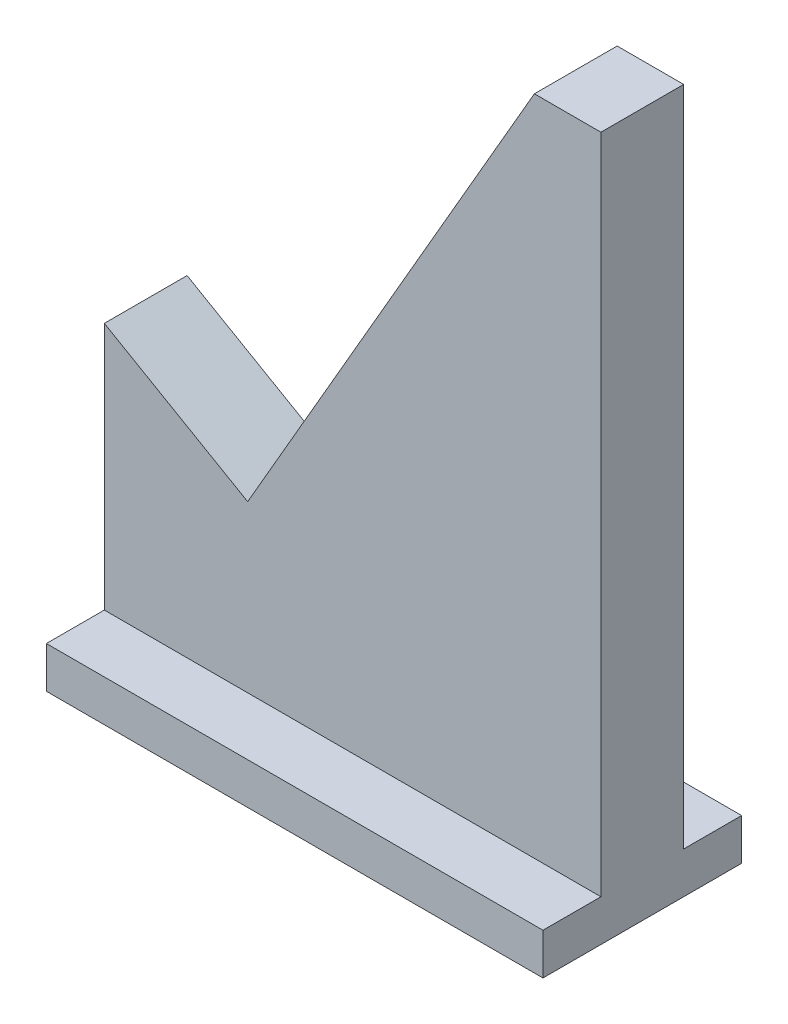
from build123d import *

# Parameters (mm, degrees)
EXTRUSION1_DEPTH = 5
ESQUISSE2_W      = 60
ESQUISSE2_H      = 5
EXTRUSION2_DEPTH = 12


with BuildPart() as part:
    # Esquisse1 → Extrusion1 (new, symmetric)
    with BuildSketch(Plane.XY):
        Polygon((-8.038475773, 80), (0, 80), (0, 0), (-60, 0), (-60, 30), (-42.679491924, 20), align=None)
    extrude(amount=EXTRUSION1_DEPTH, both=True)

    # Esquisse2 → Extrusion2 (add, symmetric)
    with BuildSketch(Plane.XY):
        with Locations((-30, -2.5)):
            Rectangle(ESQUISSE2_W, ESQUISSE2_H)
    extrude(amount=EXTRUSION2_DEPTH, both=True)


solid = part.part
